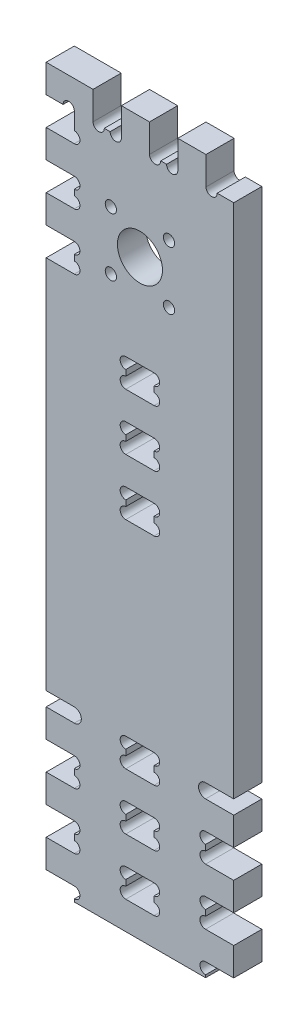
from build123d import *

# Parameters (mm, degrees)
AUFSATZ_LINEAR_AUSTRAGEN1_DEPTH = 15
SKIZZE2_R                       = 5.05
SCHNITT_LINEAR_AUSTRAGEN2_DEPTH = 7.5
SKIZZE3_R                       = 12
SKIZZE3_R_2                     = 3
SCHNITT_LINEAR_AUSTRAGEN3_DEPTH = 17.5
SCHNITT_LINEAR_AUSTRAGEN5_DEPTH = 17.5


with BuildPart() as part:
    # Skizze1 → Aufsatz-Linear austragen1 (new body)
    with BuildSketch(Plane.XY):
        with BuildLine():
            Line((0, 82.6), (15, 82.6))
            ThreePointArc((15, 82.6), (18.75, 86.35), (15, 90.1))
            Line((15, 90.1), (0, 90.1))
            Line((0, 90.1), (0, 289.970539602))
            Line((0, 289.970539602), (15, 289.970539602))
            ThreePointArc((15, 289.970539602), (18, 292.970539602), (15, 295.970539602))
            Line((15, 295.970539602), (15, 299.070539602))
            ThreePointArc((15, 299.070539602), (18, 302.070539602), (15, 305.070539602))
            Line((15, 305.070539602), (0, 305.070539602))
            Line((0, 305.070539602), (0, 320.070539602))
            Line((0, 320.070539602), (15, 320.070539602))
            ThreePointArc((15, 320.070539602), (18, 323.070539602), (15, 326.070539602))
            Line((15, 326.070539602), (15, 329.170539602))
            ThreePointArc((15, 329.170539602), (18, 332.170539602), (15, 335.170539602))
            Line((15, 335.170539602), (0, 335.170539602))
            Line((0, 335.170539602), (0, 350.170539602))
            Line((0, 350.170539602), (15, 350.170539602))
            ThreePointArc((15, 350.170539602), (18, 353.170539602), (15, 356.170539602))
            Line((15, 356.170539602), (15, 365.270539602))
            ThreePointArc((15, 365.270539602), (12, 368.270539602), (9, 365.270539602))
            Line((9, 365.270539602), (0, 365.270539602))
            Line((0, 365.270539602), (0, 380.270539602))
            Line((0, 380.270539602), (25, 380.270539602))
            Line((25, 380.270539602), (25, 365.270539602))
            ThreePointArc((25, 365.270539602), (27.999984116, 362.270539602), (31, 365.270507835))
            Line((31, 365.270507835), (34.1, 365.270507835))
            ThreePointArc((34.1, 365.270507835), (37.100015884, 362.270539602), (40.1, 365.270539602))
            Line((40.1, 365.270539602), (40.1, 380.270539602))
            Line((40.1, 380.270539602), (55.1, 380.270539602))
            Line((55.1, 380.270539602), (55.1, 365.270539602))
            ThreePointArc((55.1, 365.270539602), (58.099988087, 362.270539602), (61.1, 365.270515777))
            Line((61.1, 365.270515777), (64.2, 365.270515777))
            ThreePointArc((64.2, 365.270515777), (67.200009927, 362.270535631), (70.2, 365.270535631))
            Line((70.2, 365.270535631), (70.2, 380.270535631))
            Line((70.2, 380.270535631), (85.2, 380.270535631))
            Line((85.2, 380.270535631), (85.2, 365.270535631))
            ThreePointArc((85.2, 365.270535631), (88.264732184, 362.335267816), (91.2, 365.4))
            Line((91.2, 365.4), (100, 365.4))
            Line((100, 365.4), (100, 90.1))
            Line((100, 90.1), (85, 90.1))
            ThreePointArc((85, 90.1), (81.25, 86.35), (85, 82.6))
            Line((85, 82.6), (100, 82.6))
            Line((100, 82.6), (100, 67.6))
            Line((100, 67.6), (85, 67.6))
            ThreePointArc((85, 67.6), (82, 64.6), (85, 61.6))
            Line((85, 61.6), (85, 58.5))
            ThreePointArc((85, 58.5), (82, 55.5), (85, 52.5))
            Line((85, 52.5), (100, 52.5))
            Line((100, 52.5), (100, 37.5))
            Line((100, 37.5), (85, 37.5))
            ThreePointArc((85, 37.5), (82, 34.5), (85, 31.5))
            Line((85, 31.5), (85, 28.4))
            ThreePointArc((85, 28.4), (82, 25.4), (85, 22.4))
            Line((85, 22.4), (100, 22.4))
            Line((100, 22.4), (100, 7.4))
            Line((100, 7.4), (85, 7.4))
            ThreePointArc((85, 7.4), (82, 4.4), (85, 1.4))
            Line((85, 1.4), (85, 0))
            Line((85, 0), (15, 0))
            Line((15, 0), (15, 1.4))
            ThreePointArc((15, 1.4), (18, 4.4), (15, 7.4))
            Line((15, 7.4), (0, 7.4))
            Line((0, 7.4), (0, 22.4))
            Line((0, 22.4), (15, 22.4))
            ThreePointArc((15, 22.4), (18, 25.4), (15, 28.4))
            Line((15, 28.4), (15, 31.5))
            ThreePointArc((15, 31.5), (18, 34.5), (15, 37.5))
            Line((15, 37.5), (0, 37.5))
            Line((0, 37.5), (0, 52.5))
            Line((0, 52.5), (15, 52.5))
            ThreePointArc((15, 52.5), (18, 55.5), (15, 58.5))
            Line((15, 58.5), (15, 61.6))
            ThreePointArc((15, 61.6), (18, 64.6), (15, 67.6))
            Line((15, 67.6), (0, 67.6))
            Line((0, 67.6), (0, 82.6))
        make_face()
    extrude(amount=AUFSATZ_LINEAR_AUSTRAGEN1_DEPTH)

    # Skizze2 → Schnitt-Linear austragen2 (cut)
    with BuildSketch(Plane(origin=(0, 0, 0), x_dir=(-1, 0, 0), z_dir=(0, 0, -1))):
        with Locations((-50, 350.270515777)):
            Circle(SKIZZE2_R)
        with Locations((-50, 280.270515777)):
            Circle(SKIZZE2_R)
    extrude(amount=-SCHNITT_LINEAR_AUSTRAGEN2_DEPTH, mode=Mode.SUBTRACT)

    # Skizze3 → Schnitt-Linear austragen3 (cut)
    with BuildSketch(Plane(origin=(0, 0, 0), x_dir=(-1, 0, 0), z_dir=(0, 0, -1))):
        with Locations((-50, 315.270515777)):
            Circle(SKIZZE3_R)
        with Locations((-65.5, 330.770515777)):
            Circle(SKIZZE3_R_2)
        with Locations((-34.5, 330.770539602)):
            Circle(SKIZZE3_R_2)
        with Locations((-34.5, 299.770539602)):
            Circle(SKIZZE3_R_2)
        with Locations((-65.5, 299.770515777)):
            Circle(SKIZZE3_R_2)
    extrude(amount=-SCHNITT_LINEAR_AUSTRAGEN3_DEPTH, mode=Mode.SUBTRACT)

    # Skizze5 → Schnitt-Linear austragen5 (cut)
    with BuildSketch(Plane.XY.offset(15)):
        with BuildLine():
            ThreePointArc((42.45, 51.1), (39.45, 48.1), (42.45, 45.1))
            Line((42.45, 45.1), (57.55, 45.1))
            ThreePointArc((57.55, 45.1), (60.55, 48.1), (57.55, 51.1))
            Line((57.55, 51.1), (57.55, 54.2))
            ThreePointArc((57.55, 54.2), (60.55, 57.2), (57.55, 60.2))
            Line((57.55, 60.2), (42.45, 60.2))
            ThreePointArc((42.45, 60.2), (39.45, 57.2), (42.45, 54.2))
            Line((42.45, 54.2), (42.45, 51.1))
        make_face()
        with BuildLine():
            ThreePointArc((42.45, 21), (39.45, 18), (42.45, 15))
            Line((42.45, 15), (57.55, 15))
            ThreePointArc((57.55, 15), (60.55, 18), (57.55, 21))
            Line((57.55, 21), (57.55, 24.1))
            ThreePointArc((57.55, 24.1), (60.55, 27.1), (57.55, 30.1))
            Line((57.55, 30.1), (42.45, 30.1))
            ThreePointArc((42.45, 30.1), (39.45, 27.1), (42.45, 24.1))
            Line((42.45, 24.1), (42.45, 21))
        make_face()
        with BuildLine():
            ThreePointArc((42.45, 81.2), (39.45, 78.2), (42.45, 75.2))
            Line((42.45, 75.2), (57.55, 75.2))
            ThreePointArc((57.55, 75.2), (60.55, 78.2), (57.55, 81.2))
            Line((57.55, 81.2), (57.55, 84.3))
            ThreePointArc((57.55, 84.3), (60.55, 87.3), (57.55, 90.3))
            Line((57.55, 90.3), (42.45, 90.3))
            ThreePointArc((42.45, 90.3), (39.45, 87.3), (42.45, 84.3))
            Line((42.45, 84.3), (42.45, 81.2))
        make_face()
        with BuildLine():
            ThreePointArc((42.45, 226.4), (39.45, 223.4), (42.45, 220.4))
            Line((42.45, 220.4), (57.55, 220.4))
            ThreePointArc((57.55, 220.4), (60.55, 223.4), (57.55, 226.4))
            Line((57.55, 226.4), (57.55, 229.5))
            ThreePointArc((57.55, 229.5), (60.55, 232.5), (57.55, 235.5))
            Line((57.55, 235.5), (42.45, 235.5))
            ThreePointArc((42.45, 235.5), (39.45, 232.5), (42.45, 229.5))
            Line((42.45, 229.5), (42.45, 226.4))
        make_face()
        with BuildLine():
            ThreePointArc((42.45, 196.3), (39.45, 193.3), (42.45, 190.3))
            Line((42.45, 190.3), (57.55, 190.3))
            ThreePointArc((57.55, 190.3), (60.55, 193.3), (57.55, 196.3))
            Line((57.55, 196.3), (57.55, 199.4))
            ThreePointArc((57.55, 199.4), (60.55, 202.4), (57.55, 205.4))
            Line((57.55, 205.4), (42.45, 205.4))
            ThreePointArc((42.45, 205.4), (39.45, 202.4), (42.45, 199.4))
            Line((42.45, 199.4), (42.45, 196.3))
        make_face()
        with BuildLine():
            ThreePointArc((42.45, 256.5), (39.45, 253.5), (42.45, 250.5))
            Line((42.45, 250.5), (57.55, 250.5))
            ThreePointArc((57.55, 250.5), (60.55, 253.5), (57.55, 256.5))
            Line((57.55, 256.5), (57.55, 259.6))
            ThreePointArc((57.55, 259.6), (60.55, 262.6), (57.55, 265.6))
            Line((57.55, 265.6), (42.45, 265.6))
            ThreePointArc((42.45, 265.6), (39.45, 262.6), (42.45, 259.6))
            Line((42.45, 259.6), (42.45, 256.5))
        make_face()
    extrude(amount=-SCHNITT_LINEAR_AUSTRAGEN5_DEPTH, mode=Mode.SUBTRACT)


solid = part.part
